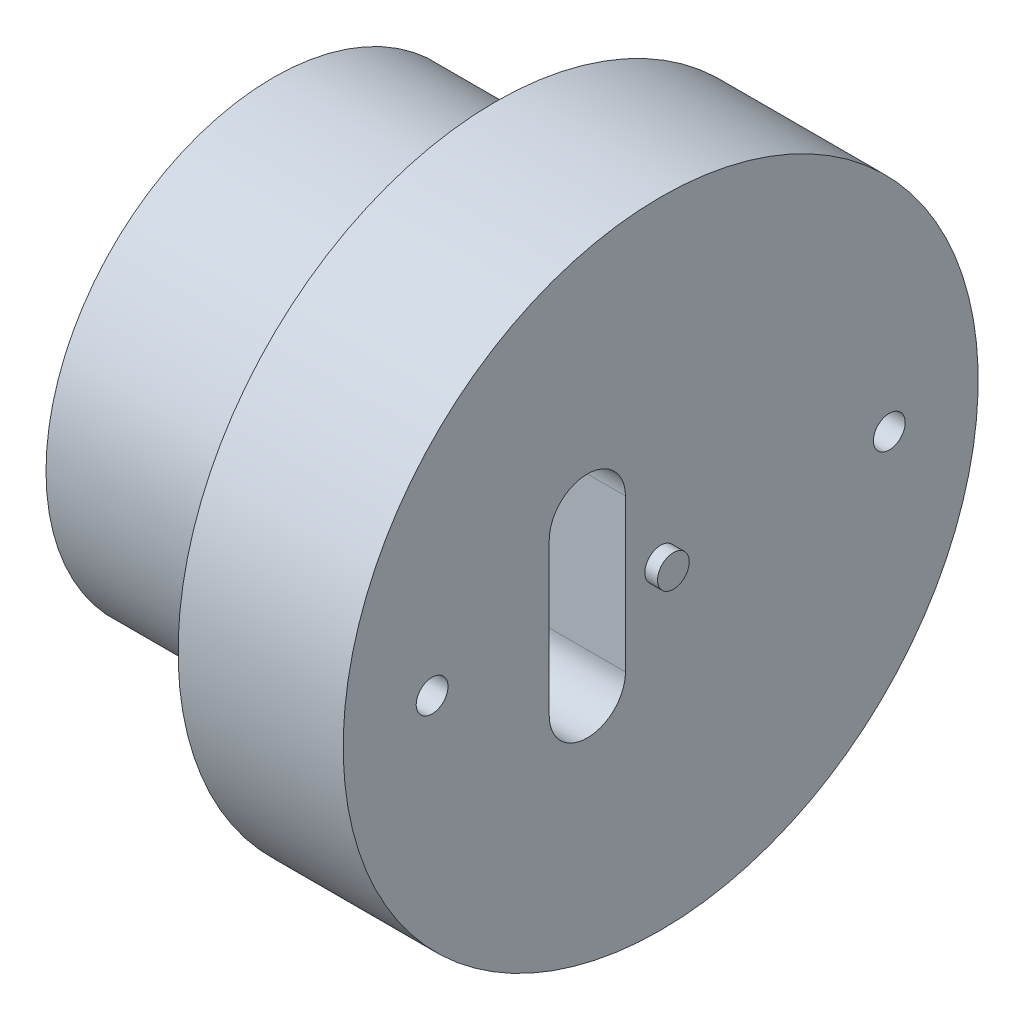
ISO-10303-21;
HEADER;
FILE_DESCRIPTION(('STEP AP214'),'2;1');
FILE_NAME('part.step','',(''),(''),'','','');
FILE_SCHEMA(('AUTOMOTIVE_DESIGN { 1 0 10303 214 1 1 1 1 }'));
ENDSEC;
DATA;
#1=APPLICATION_CONTEXT('core data for automotive mechanical design processes');
#2=APPLICATION_PROTOCOL_DEFINITION('international standard','automotive_design',2000,#1);
#3=PRODUCT_CONTEXT('',#1,'mechanical');
#4=PRODUCT('Part','Part','',(#3));
#5=PRODUCT_RELATED_PRODUCT_CATEGORY('part','',(#4));
#6=PRODUCT_DEFINITION_FORMATION('','',#4);
#7=PRODUCT_DEFINITION_CONTEXT('part definition',#1,'design');
#8=PRODUCT_DEFINITION('design','',#6,#7);
#9=PRODUCT_DEFINITION_SHAPE('','',#8);
#10=(LENGTH_UNIT() NAMED_UNIT(*) SI_UNIT(.MILLI.,.METRE.));
#11=(NAMED_UNIT(*) PLANE_ANGLE_UNIT() SI_UNIT($,.RADIAN.));
#12=(NAMED_UNIT(*) SI_UNIT($,.STERADIAN.) SOLID_ANGLE_UNIT());
#13=UNCERTAINTY_MEASURE_WITH_UNIT(LENGTH_MEASURE(1.E-05),#10,'distance_accuracy_value','');
#14=(GEOMETRIC_REPRESENTATION_CONTEXT(3) GLOBAL_UNCERTAINTY_ASSIGNED_CONTEXT((#13)) GLOBAL_UNIT_ASSIGNED_CONTEXT((#10,
#11,#12)) REPRESENTATION_CONTEXT('',''));
#15=CARTESIAN_POINT('',(0.,0.,0.));
#16=DIRECTION('',(0.,0.,1.));
#17=DIRECTION('',(1.,0.,0.));
#18=AXIS2_PLACEMENT_3D('',#15,#16,#17);
#19=CARTESIAN_POINT('',(0.,0.,0.));
#20=DIRECTION('',(-1.,0.,0.));
#21=DIRECTION('',(0.,-1.,0.));
#22=AXIS2_PLACEMENT_3D('',#19,#20,#21);
#23=PLANE('',#22);
#24=CARTESIAN_POINT('',(0.,0.,0.));
#25=DIRECTION('',(-1.,0.,0.));
#26=DIRECTION('',(0.,-1.,0.));
#27=AXIS2_PLACEMENT_3D('',#24,#25,#26);
#28=CIRCLE('',#27,24.);
#29=CARTESIAN_POINT('',(0.,-24.,0.));
#30=VERTEX_POINT('',#29);
#31=EDGE_CURVE('E119',#30,#30,#28,.T.);
#32=ORIENTED_EDGE('',*,*,#31,.F.);
#33=EDGE_LOOP('',(#32));
#34=FACE_BOUND('',#33,.T.);
#35=CARTESIAN_POINT('',(0.,0.,0.));
#36=DIRECTION('',(1.,0.,0.));
#37=DIRECTION('',(0.,1.,0.));
#38=AXIS2_PLACEMENT_3D('',#35,#36,#37);
#39=CIRCLE('',#38,35.8);
#40=CARTESIAN_POINT('',(0.,35.8,0.));
#41=VERTEX_POINT('',#40);
#42=EDGE_CURVE('E136',#41,#41,#39,.T.);
#43=ORIENTED_EDGE('',*,*,#42,.F.);
#44=EDGE_LOOP('',(#43));
#45=FACE_BOUND('',#44,.T.);
#46=ADVANCED_FACE('F34',(#34,#45),#23,.T.);
#47=CARTESIAN_POINT('',(63.,0.,0.));
#48=DIRECTION('',(1.,0.,0.));
#49=DIRECTION('',(0.,1.,0.));
#50=AXIS2_PLACEMENT_3D('',#47,#48,#49);
#51=CYLINDRICAL_SURFACE('',#50,35.8);
#52=ORIENTED_EDGE('',*,*,#42,.T.);
#53=EDGE_LOOP('',(#52));
#54=FACE_BOUND('',#53,.T.);
#55=CARTESIAN_POINT('',(35.,0.,0.));
#56=DIRECTION('',(1.,0.,0.));
#57=DIRECTION('',(0.,1.,0.));
#58=AXIS2_PLACEMENT_3D('',#55,#56,#57);
#59=CIRCLE('',#58,35.8);
#60=CARTESIAN_POINT('',(35.,35.8,0.));
#61=VERTEX_POINT('',#60);
#62=EDGE_CURVE('E133',#61,#61,#59,.T.);
#63=ORIENTED_EDGE('',*,*,#62,.F.);
#64=EDGE_LOOP('',(#63));
#65=FACE_BOUND('',#64,.T.);
#66=ADVANCED_FACE('F167',(#54,#65),#51,.T.);
#67=CARTESIAN_POINT('',(35.,35.8,0.));
#68=DIRECTION('',(-1.,0.,0.));
#69=DIRECTION('',(0.,-1.,0.));
#70=AXIS2_PLACEMENT_3D('',#67,#68,#69);
#71=PLANE('',#70);
#72=ORIENTED_EDGE('',*,*,#62,.T.);
#73=EDGE_LOOP('',(#72));
#74=FACE_BOUND('',#73,.T.);
#75=CARTESIAN_POINT('',(35.,0.,0.));
#76=DIRECTION('',(1.,0.,0.));
#77=DIRECTION('',(0.,1.,0.));
#78=AXIS2_PLACEMENT_3D('',#75,#76,#77);
#79=CIRCLE('',#78,50.);
#80=CARTESIAN_POINT('',(35.,50.,0.));
#81=VERTEX_POINT('',#80);
#82=EDGE_CURVE('E130',#81,#81,#79,.T.);
#83=ORIENTED_EDGE('',*,*,#82,.F.);
#84=EDGE_LOOP('',(#83));
#85=FACE_BOUND('',#84,.T.);
#86=ADVANCED_FACE('F172',(#74,#85),#71,.T.);
#87=CARTESIAN_POINT('',(63.,0.,0.));
#88=DIRECTION('',(1.,0.,0.));
#89=DIRECTION('',(0.,1.,0.));
#90=AXIS2_PLACEMENT_3D('',#87,#88,#89);
#91=CYLINDRICAL_SURFACE('',#90,50.);
#92=ORIENTED_EDGE('',*,*,#82,.T.);
#93=EDGE_LOOP('',(#92));
#94=FACE_BOUND('',#93,.T.);
#95=CARTESIAN_POINT('',(61.,0.,0.));
#96=DIRECTION('',(1.,0.,0.));
#97=DIRECTION('',(0.,1.,0.));
#98=AXIS2_PLACEMENT_3D('',#95,#96,#97);
#99=CIRCLE('',#98,50.);
#100=CARTESIAN_POINT('',(61.,50.,0.));
#101=VERTEX_POINT('',#100);
#102=EDGE_CURVE('E127',#101,#101,#99,.T.);
#103=ORIENTED_EDGE('',*,*,#102,.F.);
#104=EDGE_LOOP('',(#103));
#105=FACE_BOUND('',#104,.T.);
#106=ADVANCED_FACE('F182',(#94,#105),#91,.T.);
#107=CARTESIAN_POINT('',(61.,50.,0.));
#108=DIRECTION('',(1.,0.,0.));
#109=DIRECTION('',(0.,1.,0.));
#110=AXIS2_PLACEMENT_3D('',#107,#108,#109);
#111=PLANE('',#110);
#112=CARTESIAN_POINT('',(61.,-12.,11.55));
#113=DIRECTION('',(1.,0.,0.));
#114=DIRECTION('',(0.,1.,0.));
#115=AXIS2_PLACEMENT_3D('',#112,#113,#114);
#116=CIRCLE('',#115,6.);
#117=CARTESIAN_POINT('',(61.,-12.,17.55));
#118=VERTEX_POINT('',#117);
#119=CARTESIAN_POINT('',(61.,-12.,5.55));
#120=VERTEX_POINT('',#119);
#121=EDGE_CURVE('E48',#118,#120,#116,.T.);
#122=ORIENTED_EDGE('',*,*,#121,.F.);
#123=DIRECTION('',(0.,-1.,0.));
#124=VECTOR('',#123,1.);
#125=CARTESIAN_POINT('',(61.,-12.,17.55));
#126=LINE('',#125,#124);
#127=CARTESIAN_POINT('',(61.,12.,17.55));
#128=VERTEX_POINT('',#127);
#129=EDGE_CURVE('E98',#128,#118,#126,.T.);
#130=ORIENTED_EDGE('',*,*,#129,.F.);
#131=CARTESIAN_POINT('',(61.,12.,11.55));
#132=DIRECTION('',(1.,0.,0.));
#133=DIRECTION('',(0.,1.,0.));
#134=AXIS2_PLACEMENT_3D('',#131,#132,#133);
#135=CIRCLE('',#134,6.);
#136=CARTESIAN_POINT('',(61.,12.,5.55));
#137=VERTEX_POINT('',#136);
#138=EDGE_CURVE('E82',#137,#128,#135,.T.);
#139=ORIENTED_EDGE('',*,*,#138,.F.);
#140=DIRECTION('',(0.,1.,0.));
#141=VECTOR('',#140,1.);
#142=CARTESIAN_POINT('',(61.,-12.,5.55));
#143=LINE('',#142,#141);
#144=EDGE_CURVE('E91',#120,#137,#143,.T.);
#145=ORIENTED_EDGE('',*,*,#144,.F.);
#146=EDGE_LOOP('',(#122,#130,#139,#145));
#147=FACE_BOUND('',#146,.T.);
#148=CARTESIAN_POINT('',(61.,0.,36.));
#149=DIRECTION('',(1.,0.,0.));
#150=DIRECTION('',(0.,1.,0.));
#151=AXIS2_PLACEMENT_3D('',#148,#149,#150);
#152=CIRCLE('',#151,2.5);
#153=CARTESIAN_POINT('',(61.,2.5,36.));
#154=VERTEX_POINT('',#153);
#155=EDGE_CURVE('E110',#154,#154,#152,.T.);
#156=ORIENTED_EDGE('',*,*,#155,.F.);
#157=EDGE_LOOP('',(#156));
#158=FACE_BOUND('',#157,.T.);
#159=CARTESIAN_POINT('',(61.,0.,-36.));
#160=DIRECTION('',(1.,0.,0.));
#161=DIRECTION('',(0.,1.,0.));
#162=AXIS2_PLACEMENT_3D('',#159,#160,#161);
#163=CIRCLE('',#162,2.5);
#164=CARTESIAN_POINT('',(61.,2.5,-36.));
#165=VERTEX_POINT('',#164);
#166=EDGE_CURVE('E114',#165,#165,#163,.T.);
#167=ORIENTED_EDGE('',*,*,#166,.F.);
#168=EDGE_LOOP('',(#167));
#169=FACE_BOUND('',#168,.T.);
#170=ORIENTED_EDGE('',*,*,#102,.T.);
#171=EDGE_LOOP('',(#170));
#172=FACE_BOUND('',#171,.T.);
#173=CARTESIAN_POINT('',(61.,0.,0.));
#174=DIRECTION('',(1.,0.,0.));
#175=DIRECTION('',(0.,1.,0.));
#176=AXIS2_PLACEMENT_3D('',#173,#174,#175);
#177=CIRCLE('',#176,2.5);
#178=CARTESIAN_POINT('',(61.,2.5,0.));
#179=VERTEX_POINT('',#178);
#180=EDGE_CURVE('E124',#179,#179,#177,.T.);
#181=ORIENTED_EDGE('',*,*,#180,.F.);
#182=EDGE_LOOP('',(#181));
#183=FACE_BOUND('',#182,.T.);
#184=ADVANCED_FACE('F95',(#147,#158,#169,#172,#183),#111,.T.);
#185=CARTESIAN_POINT('',(63.,0.,0.));
#186=DIRECTION('',(1.,0.,0.));
#187=DIRECTION('',(0.,1.,0.));
#188=AXIS2_PLACEMENT_3D('',#185,#186,#187);
#189=CYLINDRICAL_SURFACE('',#188,2.5);
#190=ORIENTED_EDGE('',*,*,#180,.T.);
#191=EDGE_LOOP('',(#190));
#192=FACE_BOUND('',#191,.T.);
#193=CARTESIAN_POINT('',(63.,0.,0.));
#194=DIRECTION('',(1.,0.,0.));
#195=DIRECTION('',(0.,1.,0.));
#196=AXIS2_PLACEMENT_3D('',#193,#194,#195);
#197=CIRCLE('',#196,2.5);
#198=CARTESIAN_POINT('',(63.,2.5,0.));
#199=VERTEX_POINT('',#198);
#200=EDGE_CURVE('E118',#199,#199,#197,.T.);
#201=ORIENTED_EDGE('',*,*,#200,.F.);
#202=EDGE_LOOP('',(#201));
#203=FACE_BOUND('',#202,.T.);
#204=ADVANCED_FACE('F193',(#192,#203),#189,.T.);
#205=CARTESIAN_POINT('',(63.,2.5,0.));
#206=DIRECTION('',(1.,0.,0.));
#207=DIRECTION('',(0.,1.,0.));
#208=AXIS2_PLACEMENT_3D('',#205,#206,#207);
#209=PLANE('',#208);
#210=ORIENTED_EDGE('',*,*,#200,.T.);
#211=EDGE_LOOP('',(#210));
#212=FACE_BOUND('',#211,.T.);
#213=ADVANCED_FACE('F199',(#212),#209,.T.);
#214=CARTESIAN_POINT('',(28.,0.,0.));
#215=DIRECTION('',(-1.,0.,0.));
#216=DIRECTION('',(0.,-1.,0.));
#217=AXIS2_PLACEMENT_3D('',#214,#215,#216);
#218=CYLINDRICAL_SURFACE('',#217,24.);
#219=CARTESIAN_POINT('',(28.,0.,0.));
#220=DIRECTION('',(-1.,0.,0.));
#221=DIRECTION('',(0.,-1.,0.));
#222=AXIS2_PLACEMENT_3D('',#219,#220,#221);
#223=CIRCLE('',#222,24.);
#224=CARTESIAN_POINT('',(28.,-24.,0.));
#225=VERTEX_POINT('',#224);
#226=EDGE_CURVE('E115',#225,#225,#223,.T.);
#227=ORIENTED_EDGE('',*,*,#226,.F.);
#228=EDGE_LOOP('',(#227));
#229=FACE_BOUND('',#228,.T.);
#230=ORIENTED_EDGE('',*,*,#31,.T.);
#231=EDGE_LOOP('',(#230));
#232=FACE_BOUND('',#231,.T.);
#233=ADVANCED_FACE('F204',(#229,#232),#218,.F.);
#234=CARTESIAN_POINT('',(28.,0.,0.));
#235=DIRECTION('',(-1.,0.,0.));
#236=DIRECTION('',(0.,-1.,0.));
#237=AXIS2_PLACEMENT_3D('',#234,#235,#236);
#238=PLANE('',#237);
#239=CARTESIAN_POINT('',(28.,-12.,11.55));
#240=DIRECTION('',(-1.,0.,0.));
#241=DIRECTION('',(0.,-1.,0.));
#242=AXIS2_PLACEMENT_3D('',#239,#240,#241);
#243=CIRCLE('',#242,6.);
#244=CARTESIAN_POINT('',(28.,-12.,5.55));
#245=VERTEX_POINT('',#244);
#246=CARTESIAN_POINT('',(28.,-12.,17.55));
#247=VERTEX_POINT('',#246);
#248=EDGE_CURVE('E11',#245,#247,#243,.T.);
#249=ORIENTED_EDGE('',*,*,#248,.F.);
#250=DIRECTION('',(0.,-1.,0.));
#251=VECTOR('',#250,1.);
#252=CARTESIAN_POINT('',(28.,0.,5.55));
#253=LINE('',#252,#251);
#254=CARTESIAN_POINT('',(28.,12.,5.55));
#255=VERTEX_POINT('',#254);
#256=EDGE_CURVE('E139',#255,#245,#253,.T.);
#257=ORIENTED_EDGE('',*,*,#256,.F.);
#258=CARTESIAN_POINT('',(28.,12.,11.55));
#259=DIRECTION('',(-1.,0.,0.));
#260=DIRECTION('',(0.,-1.,0.));
#261=AXIS2_PLACEMENT_3D('',#258,#259,#260);
#262=CIRCLE('',#261,6.);
#263=CARTESIAN_POINT('',(28.,12.,17.55));
#264=VERTEX_POINT('',#263);
#265=EDGE_CURVE('E85',#264,#255,#262,.T.);
#266=ORIENTED_EDGE('',*,*,#265,.F.);
#267=DIRECTION('',(0.,1.,0.));
#268=VECTOR('',#267,1.);
#269=CARTESIAN_POINT('',(28.,0.,17.55));
#270=LINE('',#269,#268);
#271=EDGE_CURVE('E41',#247,#264,#270,.T.);
#272=ORIENTED_EDGE('',*,*,#271,.F.);
#273=EDGE_LOOP('',(#249,#257,#266,#272));
#274=FACE_BOUND('',#273,.T.);
#275=ORIENTED_EDGE('',*,*,#226,.T.);
#276=EDGE_LOOP('',(#275));
#277=FACE_BOUND('',#276,.T.);
#278=ADVANCED_FACE('F151',(#274,#277),#238,.T.);
#279=CARTESIAN_POINT('',(48.,0.,-36.));
#280=DIRECTION('',(1.,0.,0.));
#281=DIRECTION('',(0.,0.,-1.));
#282=AXIS2_PLACEMENT_3D('',#279,#280,#281);
#283=CONICAL_SURFACE('',#282,2.5,1.02974425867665);
#284=CARTESIAN_POINT('',(46.4978484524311,0.,-36.));
#285=VERTEX_POINT('',#284);
#286=VERTEX_LOOP('',#285);
#287=FACE_BOUND('',#286,.T.);
#288=CARTESIAN_POINT('',(48.,0.,-36.));
#289=DIRECTION('',(1.,0.,0.));
#290=DIRECTION('',(0.,0.,-1.));
#291=AXIS2_PLACEMENT_3D('',#288,#289,#290);
#292=CIRCLE('',#291,2.5);
#293=CARTESIAN_POINT('',(48.,0.,-38.5));
#294=VERTEX_POINT('',#293);
#295=EDGE_CURVE('E111',#294,#294,#292,.T.);
#296=ORIENTED_EDGE('',*,*,#295,.T.);
#297=EDGE_LOOP('',(#296));
#298=FACE_BOUND('',#297,.T.);
#299=ADVANCED_FACE('F214',(#287,#298),#283,.F.);
#300=CARTESIAN_POINT('',(63.,0.,-36.));
#301=DIRECTION('',(1.,0.,0.));
#302=DIRECTION('',(0.,0.,-1.));
#303=AXIS2_PLACEMENT_3D('',#300,#301,#302);
#304=CYLINDRICAL_SURFACE('',#303,2.5);
#305=ORIENTED_EDGE('',*,*,#166,.T.);
#306=EDGE_LOOP('',(#305));
#307=FACE_BOUND('',#306,.T.);
#308=ORIENTED_EDGE('',*,*,#295,.F.);
#309=EDGE_LOOP('',(#308));
#310=FACE_BOUND('',#309,.T.);
#311=ADVANCED_FACE('F217',(#307,#310),#304,.F.);
#312=CARTESIAN_POINT('',(48.,0.,36.));
#313=DIRECTION('',(1.,0.,0.));
#314=DIRECTION('',(0.,0.,-1.));
#315=AXIS2_PLACEMENT_3D('',#312,#313,#314);
#316=CONICAL_SURFACE('',#315,2.5,1.02974425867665);
#317=CARTESIAN_POINT('',(46.4978484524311,0.,36.));
#318=VERTEX_POINT('',#317);
#319=VERTEX_LOOP('',#318);
#320=FACE_BOUND('',#319,.T.);
#321=CARTESIAN_POINT('',(48.,0.,36.));
#322=DIRECTION('',(1.,0.,0.));
#323=DIRECTION('',(0.,0.,-1.));
#324=AXIS2_PLACEMENT_3D('',#321,#322,#323);
#325=CIRCLE('',#324,2.5);
#326=CARTESIAN_POINT('',(48.,0.,33.5));
#327=VERTEX_POINT('',#326);
#328=EDGE_CURVE('E105',#327,#327,#325,.T.);
#329=ORIENTED_EDGE('',*,*,#328,.T.);
#330=EDGE_LOOP('',(#329));
#331=FACE_BOUND('',#330,.T.);
#332=ADVANCED_FACE('F162',(#320,#331),#316,.F.);
#333=CARTESIAN_POINT('',(63.,0.,36.));
#334=DIRECTION('',(1.,0.,0.));
#335=DIRECTION('',(0.,0.,-1.));
#336=AXIS2_PLACEMENT_3D('',#333,#334,#335);
#337=CYLINDRICAL_SURFACE('',#336,2.5);
#338=ORIENTED_EDGE('',*,*,#155,.T.);
#339=EDGE_LOOP('',(#338));
#340=FACE_BOUND('',#339,.T.);
#341=ORIENTED_EDGE('',*,*,#328,.F.);
#342=EDGE_LOOP('',(#341));
#343=FACE_BOUND('',#342,.T.);
#344=ADVANCED_FACE('F155',(#340,#343),#337,.F.);
#345=CARTESIAN_POINT('',(0.,-12.,11.55));
#346=DIRECTION('',(1.,0.,0.));
#347=DIRECTION('',(0.,1.,0.));
#348=AXIS2_PLACEMENT_3D('',#345,#346,#347);
#349=CYLINDRICAL_SURFACE('',#348,6.);
#350=ORIENTED_EDGE('',*,*,#248,.T.);
#351=DIRECTION('',(1.,0.,0.));
#352=VECTOR('',#351,1.);
#353=CARTESIAN_POINT('',(0.,-12.,17.55));
#354=LINE('',#353,#352);
#355=EDGE_CURVE('E103',#247,#118,#354,.T.);
#356=ORIENTED_EDGE('',*,*,#355,.T.);
#357=ORIENTED_EDGE('',*,*,#121,.T.);
#358=DIRECTION('',(1.,0.,0.));
#359=VECTOR('',#358,1.);
#360=CARTESIAN_POINT('',(0.,-12.,5.55));
#361=LINE('',#360,#359);
#362=EDGE_CURVE('E88',#245,#120,#361,.T.);
#363=ORIENTED_EDGE('',*,*,#362,.F.);
#364=EDGE_LOOP('',(#350,#356,#357,#363));
#365=FACE_BOUND('',#364,.T.);
#366=ADVANCED_FACE('F153',(#365),#349,.F.);
#367=CARTESIAN_POINT('',(0.,-12.,17.55));
#368=DIRECTION('',(0.,0.,1.));
#369=DIRECTION('',(1.,0.,0.));
#370=AXIS2_PLACEMENT_3D('',#367,#368,#369);
#371=PLANE('',#370);
#372=ORIENTED_EDGE('',*,*,#271,.T.);
#373=DIRECTION('',(1.,0.,0.));
#374=VECTOR('',#373,1.);
#375=CARTESIAN_POINT('',(0.,12.,17.55));
#376=LINE('',#375,#374);
#377=EDGE_CURVE('E87',#264,#128,#376,.T.);
#378=ORIENTED_EDGE('',*,*,#377,.T.);
#379=ORIENTED_EDGE('',*,*,#129,.T.);
#380=ORIENTED_EDGE('',*,*,#355,.F.);
#381=EDGE_LOOP('',(#372,#378,#379,#380));
#382=FACE_BOUND('',#381,.T.);
#383=ADVANCED_FACE('F148',(#382),#371,.F.);
#384=CARTESIAN_POINT('',(0.,12.,11.55));
#385=DIRECTION('',(1.,0.,0.));
#386=DIRECTION('',(0.,1.,0.));
#387=AXIS2_PLACEMENT_3D('',#384,#385,#386);
#388=CYLINDRICAL_SURFACE('',#387,6.);
#389=ORIENTED_EDGE('',*,*,#265,.T.);
#390=DIRECTION('',(1.,0.,0.));
#391=VECTOR('',#390,1.);
#392=CARTESIAN_POINT('',(0.,12.,5.55));
#393=LINE('',#392,#391);
#394=EDGE_CURVE('E56',#255,#137,#393,.T.);
#395=ORIENTED_EDGE('',*,*,#394,.T.);
#396=ORIENTED_EDGE('',*,*,#138,.T.);
#397=ORIENTED_EDGE('',*,*,#377,.F.);
#398=EDGE_LOOP('',(#389,#395,#396,#397));
#399=FACE_BOUND('',#398,.T.);
#400=ADVANCED_FACE('F79',(#399),#388,.F.);
#401=CARTESIAN_POINT('',(0.,-12.,5.55));
#402=DIRECTION('',(0.,0.,-1.));
#403=DIRECTION('',(-1.,0.,0.));
#404=AXIS2_PLACEMENT_3D('',#401,#402,#403);
#405=PLANE('',#404);
#406=ORIENTED_EDGE('',*,*,#256,.T.);
#407=ORIENTED_EDGE('',*,*,#362,.T.);
#408=ORIENTED_EDGE('',*,*,#144,.T.);
#409=ORIENTED_EDGE('',*,*,#394,.F.);
#410=EDGE_LOOP('',(#406,#407,#408,#409));
#411=FACE_BOUND('',#410,.T.);
#412=ADVANCED_FACE('F92',(#411),#405,.F.);
#413=CLOSED_SHELL('',(#46,#66,#86,#106,#184,#204,#213,#233,#278,#299,#311,#332,#344,#366,#383,
#400,#412));
#414=MANIFOLD_SOLID_BREP('B2',#413);
#415=ADVANCED_BREP_SHAPE_REPRESENTATION('',(#18,#414),#14);
#416=SHAPE_DEFINITION_REPRESENTATION(#9,#415);
ENDSEC;
END-ISO-10303-21;
